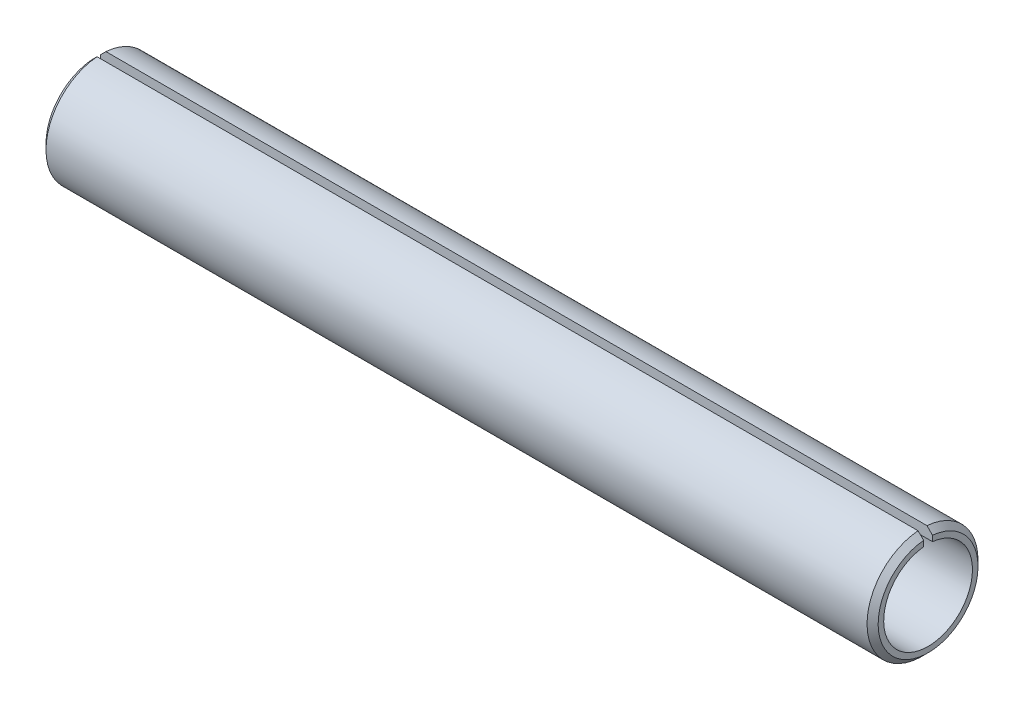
ISO-10303-21;
HEADER;
FILE_DESCRIPTION(('STEP AP214'),'2;1');
FILE_NAME('part.step','',(''),(''),'','','');
FILE_SCHEMA(('AUTOMOTIVE_DESIGN { 1 0 10303 214 1 1 1 1 }'));
ENDSEC;
DATA;
#1=APPLICATION_CONTEXT('core data for automotive mechanical design processes');
#2=APPLICATION_PROTOCOL_DEFINITION('international standard','automotive_design',2000,#1);
#3=PRODUCT_CONTEXT('',#1,'mechanical');
#4=PRODUCT('Part','Part','',(#3));
#5=PRODUCT_RELATED_PRODUCT_CATEGORY('part','',(#4));
#6=PRODUCT_DEFINITION_FORMATION('','',#4);
#7=PRODUCT_DEFINITION_CONTEXT('part definition',#1,'design');
#8=PRODUCT_DEFINITION('design','',#6,#7);
#9=PRODUCT_DEFINITION_SHAPE('','',#8);
#10=(LENGTH_UNIT() NAMED_UNIT(*) SI_UNIT(.MILLI.,.METRE.));
#11=(NAMED_UNIT(*) PLANE_ANGLE_UNIT() SI_UNIT($,.RADIAN.));
#12=(NAMED_UNIT(*) SI_UNIT($,.STERADIAN.) SOLID_ANGLE_UNIT());
#13=UNCERTAINTY_MEASURE_WITH_UNIT(LENGTH_MEASURE(1.E-05),#10,'distance_accuracy_value','');
#14=(GEOMETRIC_REPRESENTATION_CONTEXT(3) GLOBAL_UNCERTAINTY_ASSIGNED_CONTEXT((#13)) GLOBAL_UNIT_ASSIGNED_CONTEXT((#10,
#11,#12)) REPRESENTATION_CONTEXT('',''));
#15=CARTESIAN_POINT('',(0.,0.,0.));
#16=DIRECTION('',(0.,0.,1.));
#17=DIRECTION('',(1.,0.,0.));
#18=AXIS2_PLACEMENT_3D('',#15,#16,#17);
#19=CARTESIAN_POINT('',(0.,0.,0.));
#20=DIRECTION('',(-1.,0.,0.));
#21=DIRECTION('',(0.,0.,1.));
#22=AXIS2_PLACEMENT_3D('',#19,#20,#21);
#23=CYLINDRICAL_SURFACE('',#22,0.8);
#24=DIRECTION('',(-1.,0.,0.));
#25=VECTOR('',#24,1.);
#26=CARTESIAN_POINT('',(15.,0.795989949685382,0.079999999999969));
#27=LINE('',#26,#25);
#28=CARTESIAN_POINT('',(15.,0.795989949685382,0.079999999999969));
#29=VERTEX_POINT('',#28);
#30=CARTESIAN_POINT('',(0.,0.795989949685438,0.0800000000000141));
#31=VERTEX_POINT('',#30);
#32=EDGE_CURVE('E44',#29,#31,#27,.T.);
#33=ORIENTED_EDGE('',*,*,#32,.F.);
#34=CARTESIAN_POINT('',(15.,1.11022302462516E-13,0.));
#35=DIRECTION('',(-1.,0.,0.));
#36=DIRECTION('',(0.,0.,1.));
#37=AXIS2_PLACEMENT_3D('',#34,#35,#36);
#38=CIRCLE('',#37,0.8);
#39=CARTESIAN_POINT('',(15.,0.795989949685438,-0.0799999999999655));
#40=VERTEX_POINT('',#39);
#41=EDGE_CURVE('E86',#40,#29,#38,.T.);
#42=ORIENTED_EDGE('',*,*,#41,.F.);
#43=DIRECTION('',(-1.,0.,0.));
#44=VECTOR('',#43,1.);
#45=CARTESIAN_POINT('',(15.,0.795989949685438,-0.0799999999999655));
#46=LINE('',#45,#44);
#47=CARTESIAN_POINT('',(0.,0.795989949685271,-0.0799999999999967));
#48=VERTEX_POINT('',#47);
#49=EDGE_CURVE('E80',#40,#48,#46,.T.);
#50=ORIENTED_EDGE('',*,*,#49,.T.);
#51=CARTESIAN_POINT('',(0.,0.,0.));
#52=DIRECTION('',(-1.,0.,0.));
#53=DIRECTION('',(0.,0.,1.));
#54=AXIS2_PLACEMENT_3D('',#51,#52,#53);
#55=CIRCLE('',#54,0.8);
#56=EDGE_CURVE('E90',#48,#31,#55,.T.);
#57=ORIENTED_EDGE('',*,*,#56,.T.);
#58=EDGE_LOOP('',(#33,#42,#50,#57));
#59=FACE_BOUND('',#58,.T.);
#60=ADVANCED_FACE('F30',(#59),#23,.F.);
#61=CARTESIAN_POINT('',(15.,0.800000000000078,0.));
#62=DIRECTION('',(-1.,0.,0.));
#63=DIRECTION('',(0.,0.,1.));
#64=AXIS2_PLACEMENT_3D('',#61,#62,#63);
#65=PLANE('',#64);
#66=DIRECTION('',(0.,-0.999999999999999,0.));
#67=VECTOR('',#66,1.);
#68=CARTESIAN_POINT('',(15.,0.996794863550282,0.0800000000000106));
#69=LINE('',#68,#67);
#70=CARTESIAN_POINT('',(15.,0.896437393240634,0.0800000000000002));
#71=VERTEX_POINT('',#70);
#72=EDGE_CURVE('E121',#71,#29,#69,.T.);
#73=ORIENTED_EDGE('',*,*,#72,.F.);
#74=CARTESIAN_POINT('',(15.,1.11022302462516E-13,0.));
#75=DIRECTION('',(-1.,0.,0.));
#76=DIRECTION('',(0.,0.,1.));
#77=AXIS2_PLACEMENT_3D('',#74,#75,#76);
#78=CIRCLE('',#77,0.900000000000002);
#79=CARTESIAN_POINT('',(15.,0.89643739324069,-0.0799999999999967));
#80=VERTEX_POINT('',#79);
#81=EDGE_CURVE('E114',#80,#71,#78,.T.);
#82=ORIENTED_EDGE('',*,*,#81,.F.);
#83=DIRECTION('',(0.,-0.999999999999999,0.));
#84=VECTOR('',#83,1.);
#85=CARTESIAN_POINT('',(15.,0.996794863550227,-0.0799999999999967));
#86=LINE('',#85,#84);
#87=EDGE_CURVE('E122',#80,#40,#86,.T.);
#88=ORIENTED_EDGE('',*,*,#87,.T.);
#89=ORIENTED_EDGE('',*,*,#41,.T.);
#90=EDGE_LOOP('',(#73,#82,#88,#89));
#91=FACE_BOUND('',#90,.T.);
#92=ADVANCED_FACE('F119',(#91),#65,.F.);
#93=CARTESIAN_POINT('',(15.,1.11022302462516E-13,0.));
#94=DIRECTION('',(-1.,0.,0.));
#95=DIRECTION('',(0.,0.,1.));
#96=AXIS2_PLACEMENT_3D('',#93,#94,#95);
#97=CONICAL_SURFACE('',#96,0.900000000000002,0.785398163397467);
#98=CARTESIAN_POINT('',(14.6603384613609,1.23707749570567,0.0800000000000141));
#99=CARTESIAN_POINT('',(14.7128036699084,1.18450161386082,0.0800000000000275));
#100=CARTESIAN_POINT('',(14.76526305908,1.13191992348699,0.0800000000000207));
#101=CARTESIAN_POINT('',(14.8701603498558,1.02673517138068,0.0800000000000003));
#102=CARTESIAN_POINT('',(14.9225982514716,0.974132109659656,0.0799999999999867));
#103=CARTESIAN_POINT('',(15.0274428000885,0.868894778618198,0.079999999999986));
#104=CARTESIAN_POINT('',(15.0798494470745,0.816260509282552,0.079999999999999));
#105=CARTESIAN_POINT('',(15.1846009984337,0.710930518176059,0.0800000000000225));
#106=CARTESIAN_POINT('',(15.2369459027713,0.658234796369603,0.0800000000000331));
#107=CARTESIAN_POINT('',(15.2892446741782,0.605493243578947,0.080000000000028));
#108=B_SPLINE_CURVE_WITH_KNOTS('',3,(#98,#99,#100,#101,#102,#103,#104,#105,#106,#107),
.UNSPECIFIED.,.F.,.F.,(4,2,2,2,4),(0.,0.222825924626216,0.445651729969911,0.668477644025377,
0.891303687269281),.UNSPECIFIED.);
#109=CARTESIAN_POINT('',(14.9,0.996794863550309,0.0800000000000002));
#110=VERTEX_POINT('',#109);
#111=EDGE_CURVE('E96',#110,#71,#108,.T.);
#112=ORIENTED_EDGE('',*,*,#111,.F.);
#113=CARTESIAN_POINT('',(14.9,1.11022302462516E-13,0.));
#114=DIRECTION('',(-1.,0.,0.));
#115=DIRECTION('',(0.,0.,1.));
#116=AXIS2_PLACEMENT_3D('',#113,#114,#115);
#117=CIRCLE('',#116,1.);
#118=CARTESIAN_POINT('',(14.9,0.996794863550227,-0.0799999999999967));
#119=VERTEX_POINT('',#118);
#120=EDGE_CURVE('E111',#119,#110,#117,.T.);
#121=ORIENTED_EDGE('',*,*,#120,.F.);
#122=CARTESIAN_POINT('',(14.6603384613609,1.23707749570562,-0.080000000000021));
#123=CARTESIAN_POINT('',(14.7128036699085,1.1845016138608,-0.080000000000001));
#124=CARTESIAN_POINT('',(14.76526305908,1.13191992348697,-0.0799999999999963));
#125=CARTESIAN_POINT('',(14.8701603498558,1.02673517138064,-0.0799999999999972));
#126=CARTESIAN_POINT('',(14.9225982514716,0.974132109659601,-0.0800000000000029));
#127=CARTESIAN_POINT('',(15.0274428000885,0.868894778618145,-0.0800000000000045));
#128=CARTESIAN_POINT('',(15.0798494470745,0.816260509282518,-0.0800000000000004));
#129=CARTESIAN_POINT('',(15.1846009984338,0.710930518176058,-0.0799999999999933));
#130=CARTESIAN_POINT('',(15.2369459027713,0.658234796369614,-0.0799999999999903));
#131=CARTESIAN_POINT('',(15.2892446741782,0.605493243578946,-0.0799999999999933));
#132=B_SPLINE_CURVE_WITH_KNOTS('',3,(#122,#123,#124,#125,#126,#127,#128,#129,#130,#131),
.UNSPECIFIED.,.F.,.F.,(4,2,2,2,4),(0.,0.222825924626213,0.445651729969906,0.668477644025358,
0.891303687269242),.UNSPECIFIED.);
#133=EDGE_CURVE('E138',#119,#80,#132,.T.);
#134=ORIENTED_EDGE('',*,*,#133,.T.);
#135=ORIENTED_EDGE('',*,*,#81,.T.);
#136=EDGE_LOOP('',(#112,#121,#134,#135));
#137=FACE_BOUND('',#136,.T.);
#138=ADVANCED_FACE('F160',(#137),#97,.T.);
#139=CARTESIAN_POINT('',(0.,0.,0.));
#140=DIRECTION('',(-1.,0.,0.));
#141=DIRECTION('',(0.,0.,1.));
#142=AXIS2_PLACEMENT_3D('',#139,#140,#141);
#143=CYLINDRICAL_SURFACE('',#142,1.);
#144=DIRECTION('',(-1.,0.,0.));
#145=VECTOR('',#144,1.);
#146=CARTESIAN_POINT('',(15.,0.996794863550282,0.0800000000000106));
#147=LINE('',#146,#145);
#148=CARTESIAN_POINT('',(0.10000000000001,0.996794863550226,0.0800000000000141));
#149=VERTEX_POINT('',#148);
#150=EDGE_CURVE('E129',#110,#149,#147,.T.);
#151=ORIENTED_EDGE('',*,*,#150,.T.);
#152=CARTESIAN_POINT('',(0.0999999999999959,0.,0.));
#153=DIRECTION('',(-1.,0.,0.));
#154=DIRECTION('',(0.,0.,1.));
#155=AXIS2_PLACEMENT_3D('',#152,#153,#154);
#156=CIRCLE('',#155,1.);
#157=CARTESIAN_POINT('',(0.10000000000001,0.996794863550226,-0.0799999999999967));
#158=VERTEX_POINT('',#157);
#159=EDGE_CURVE('E98',#158,#149,#156,.T.);
#160=ORIENTED_EDGE('',*,*,#159,.F.);
#161=DIRECTION('',(-1.,0.,0.));
#162=VECTOR('',#161,1.);
#163=CARTESIAN_POINT('',(15.,0.996794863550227,-0.0799999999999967));
#164=LINE('',#163,#162);
#165=EDGE_CURVE('E92',#119,#158,#164,.T.);
#166=ORIENTED_EDGE('',*,*,#165,.F.);
#167=ORIENTED_EDGE('',*,*,#120,.T.);
#168=EDGE_LOOP('',(#151,#160,#166,#167));
#169=FACE_BOUND('',#168,.T.);
#170=ADVANCED_FACE('F164',(#169),#143,.T.);
#171=CARTESIAN_POINT('',(0.0999999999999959,0.,0.));
#172=DIRECTION('',(1.,0.,0.));
#173=DIRECTION('',(0.,0.,-1.));
#174=AXIS2_PLACEMENT_3D('',#171,#172,#173);
#175=CONICAL_SURFACE('',#174,1.,0.785398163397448);
#176=CARTESIAN_POINT('',(-0.289244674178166,0.605493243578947,0.0800000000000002));
#177=CARTESIAN_POINT('',(-0.236945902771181,0.658234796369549,0.079999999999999));
#178=CARTESIAN_POINT('',(-0.184600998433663,0.710930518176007,0.0800000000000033));
#179=CARTESIAN_POINT('',(-0.0798494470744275,0.816260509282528,0.0800000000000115));
#180=CARTESIAN_POINT('',(-0.0274428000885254,0.868894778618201,0.0800000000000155));
#181=CARTESIAN_POINT('',(0.0774017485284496,0.974132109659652,0.0800000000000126));
#182=CARTESIAN_POINT('',(0.129839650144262,1.02673517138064,0.0800000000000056));
#183=CARTESIAN_POINT('',(0.234736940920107,1.13191992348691,0.0800000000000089));
#184=CARTESIAN_POINT('',(0.287196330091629,1.18450161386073,0.0800000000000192));
#185=CARTESIAN_POINT('',(0.339661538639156,1.23707749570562,0.0800000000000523));
#186=B_SPLINE_CURVE_WITH_KNOTS('',3,(#176,#177,#178,#179,#180,#181,#182,#183,#184,#185),
.UNSPECIFIED.,.F.,.F.,(4,2,2,2,4),(0.,0.222826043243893,0.445651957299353,0.66847776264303,
0.89130368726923),.UNSPECIFIED.);
#187=CARTESIAN_POINT('',(0.,0.896437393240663,0.0799999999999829));
#188=VERTEX_POINT('',#187);
#189=EDGE_CURVE('E100',#188,#149,#186,.T.);
#190=ORIENTED_EDGE('',*,*,#189,.F.);
#191=CARTESIAN_POINT('',(0.,0.,0.));
#192=DIRECTION('',(-1.,0.,0.));
#193=DIRECTION('',(0.,0.,1.));
#194=AXIS2_PLACEMENT_3D('',#191,#192,#193);
#195=CIRCLE('',#194,0.900000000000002);
#196=CARTESIAN_POINT('',(0.,0.896437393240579,-0.0799999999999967));
#197=VERTEX_POINT('',#196);
#198=EDGE_CURVE('E95',#197,#188,#195,.T.);
#199=ORIENTED_EDGE('',*,*,#198,.F.);
#200=CARTESIAN_POINT('',(-0.28924467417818,0.605493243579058,-0.0799999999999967));
#201=CARTESIAN_POINT('',(-0.236945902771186,0.658234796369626,-0.0800000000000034));
#202=CARTESIAN_POINT('',(-0.184600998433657,0.710930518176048,-0.0800000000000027));
#203=CARTESIAN_POINT('',(-0.0798494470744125,0.816260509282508,-0.0799999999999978));
#204=CARTESIAN_POINT('',(-0.0274428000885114,0.868894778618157,-0.0799999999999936));
#205=CARTESIAN_POINT('',(0.0774017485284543,0.974132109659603,-0.0799999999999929));
#206=CARTESIAN_POINT('',(0.129839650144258,1.02673517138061,-0.0799999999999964));
#207=CARTESIAN_POINT('',(0.234736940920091,1.13191992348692,-0.0800000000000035));
#208=CARTESIAN_POINT('',(0.287196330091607,1.18450161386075,-0.0800000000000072));
#209=CARTESIAN_POINT('',(0.339661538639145,1.23707749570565,-0.0800000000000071));
#210=B_SPLINE_CURVE_WITH_KNOTS('',3,(#200,#201,#202,#203,#204,#205,#206,#207,#208,#209),
.UNSPECIFIED.,.F.,.F.,(4,2,2,2,4),(0.,0.222826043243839,0.445651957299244,0.668477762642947,
0.891303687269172),.UNSPECIFIED.);
#211=EDGE_CURVE('E51',#197,#158,#210,.T.);
#212=ORIENTED_EDGE('',*,*,#211,.T.);
#213=ORIENTED_EDGE('',*,*,#159,.T.);
#214=EDGE_LOOP('',(#190,#199,#212,#213));
#215=FACE_BOUND('',#214,.T.);
#216=ADVANCED_FACE('F142',(#215),#175,.T.);
#217=CARTESIAN_POINT('',(0.,0.800000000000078,0.));
#218=DIRECTION('',(-1.,0.,0.));
#219=DIRECTION('',(0.,0.,1.));
#220=AXIS2_PLACEMENT_3D('',#217,#218,#219);
#221=PLANE('',#220);
#222=ORIENTED_EDGE('',*,*,#198,.T.);
#223=DIRECTION('',(0.,-0.999999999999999,0.));
#224=VECTOR('',#223,1.);
#225=CARTESIAN_POINT('',(0.,0.800000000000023,0.0799999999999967));
#226=LINE('',#225,#224);
#227=EDGE_CURVE('E11',#188,#31,#226,.T.);
#228=ORIENTED_EDGE('',*,*,#227,.T.);
#229=ORIENTED_EDGE('',*,*,#56,.F.);
#230=DIRECTION('',(0.,-0.999999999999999,0.));
#231=VECTOR('',#230,1.);
#232=CARTESIAN_POINT('',(0.,0.800000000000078,-0.0800000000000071));
#233=LINE('',#232,#231);
#234=EDGE_CURVE('E37',#197,#48,#233,.T.);
#235=ORIENTED_EDGE('',*,*,#234,.F.);
#236=EDGE_LOOP('',(#222,#228,#229,#235));
#237=FACE_BOUND('',#236,.T.);
#238=ADVANCED_FACE('F94',(#237),#221,.T.);
#239=CARTESIAN_POINT('',(15.,0.996794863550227,-0.0799999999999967));
#240=DIRECTION('',(0.,0.,-1.));
#241=DIRECTION('',(0.,0.999999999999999,0.));
#242=AXIS2_PLACEMENT_3D('',#239,#240,#241);
#243=PLANE('',#242);
#244=ORIENTED_EDGE('',*,*,#165,.T.);
#245=ORIENTED_EDGE('',*,*,#211,.F.);
#246=ORIENTED_EDGE('',*,*,#234,.T.);
#247=ORIENTED_EDGE('',*,*,#49,.F.);
#248=ORIENTED_EDGE('',*,*,#87,.F.);
#249=ORIENTED_EDGE('',*,*,#133,.F.);
#250=EDGE_LOOP('',(#244,#245,#246,#247,#248,#249));
#251=FACE_BOUND('',#250,.T.);
#252=ADVANCED_FACE('F79',(#251),#243,.F.);
#253=CARTESIAN_POINT('',(15.,0.996794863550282,0.0800000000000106));
#254=DIRECTION('',(0.,0.,-1.));
#255=DIRECTION('',(0.,0.999999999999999,0.));
#256=AXIS2_PLACEMENT_3D('',#253,#254,#255);
#257=PLANE('',#256);
#258=ORIENTED_EDGE('',*,*,#111,.T.);
#259=ORIENTED_EDGE('',*,*,#72,.T.);
#260=ORIENTED_EDGE('',*,*,#32,.T.);
#261=ORIENTED_EDGE('',*,*,#227,.F.);
#262=ORIENTED_EDGE('',*,*,#189,.T.);
#263=ORIENTED_EDGE('',*,*,#150,.F.);
#264=EDGE_LOOP('',(#258,#259,#260,#261,#262,#263));
#265=FACE_BOUND('',#264,.T.);
#266=ADVANCED_FACE('F148',(#265),#257,.T.);
#267=CLOSED_SHELL('',(#60,#92,#138,#170,#216,#238,#252,#266));
#268=MANIFOLD_SOLID_BREP('B2',#267);
#269=ADVANCED_BREP_SHAPE_REPRESENTATION('',(#18,#268),#14);
#270=SHAPE_DEFINITION_REPRESENTATION(#9,#269);
ENDSEC;
END-ISO-10303-21;
